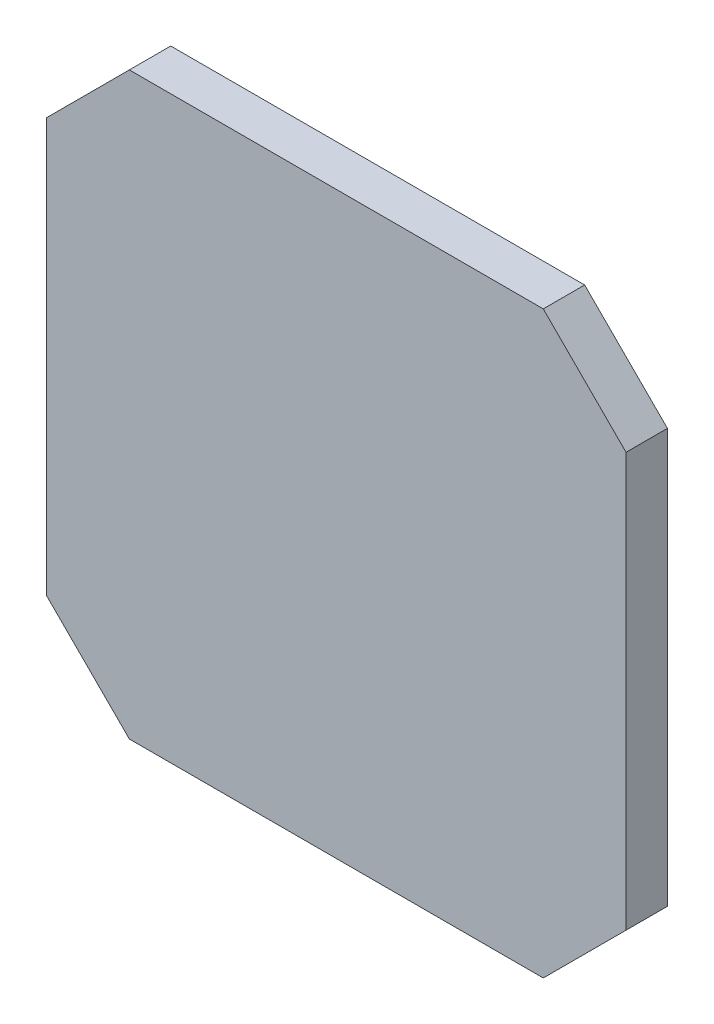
from build123d import *

# Parameters (mm, degrees)
BASE_EXTRUSION_DEPTH = 5


with BuildPart() as part:
    # Esquisse1 → Base-Extrusion (new body)
    with BuildSketch(Plane.XY):
        Polygon((60, 0), (70, -10), (70, -60), (60, -70), (10, -70), (0, -60), (0, -10), (10, 0), align=None)
    extrude(amount=BASE_EXTRUSION_DEPTH)


solid = part.part
